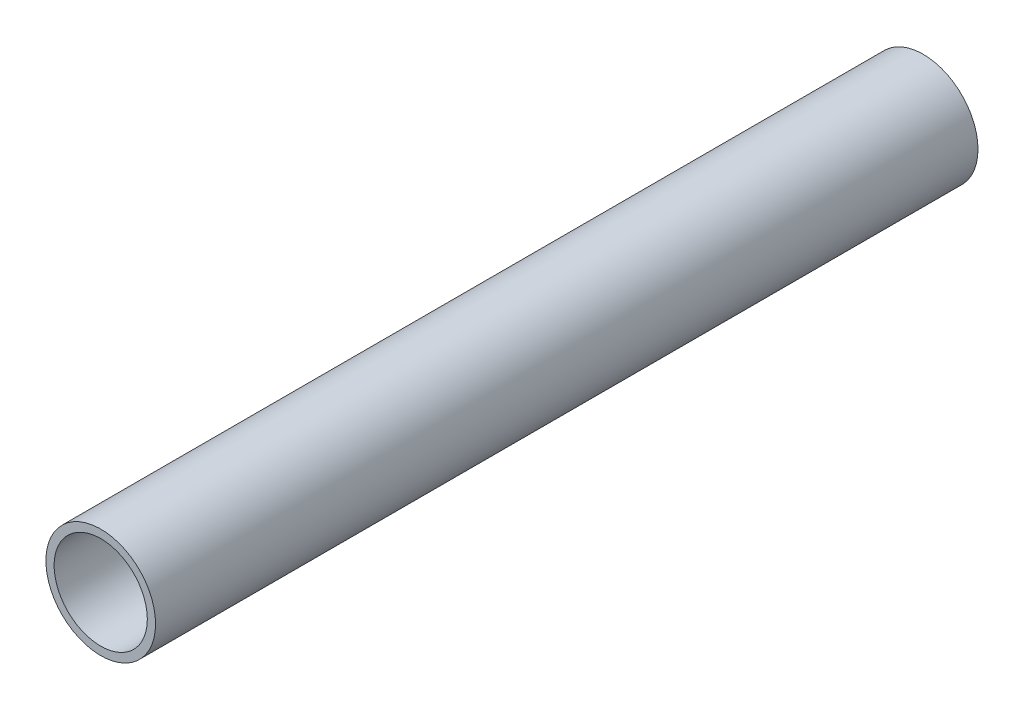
ISO-10303-21;
HEADER;
FILE_DESCRIPTION(('STEP AP214'),'2;1');
FILE_NAME('part.step','',(''),(''),'','','');
FILE_SCHEMA(('AUTOMOTIVE_DESIGN { 1 0 10303 214 1 1 1 1 }'));
ENDSEC;
DATA;
#1=APPLICATION_CONTEXT('core data for automotive mechanical design processes');
#2=APPLICATION_PROTOCOL_DEFINITION('international standard','automotive_design',2000,#1);
#3=PRODUCT_CONTEXT('',#1,'mechanical');
#4=PRODUCT('Part','Part','',(#3));
#5=PRODUCT_RELATED_PRODUCT_CATEGORY('part','',(#4));
#6=PRODUCT_DEFINITION_FORMATION('','',#4);
#7=PRODUCT_DEFINITION_CONTEXT('part definition',#1,'design');
#8=PRODUCT_DEFINITION('design','',#6,#7);
#9=PRODUCT_DEFINITION_SHAPE('','',#8);
#10=(LENGTH_UNIT() NAMED_UNIT(*) SI_UNIT(.MILLI.,.METRE.));
#11=(NAMED_UNIT(*) PLANE_ANGLE_UNIT() SI_UNIT($,.RADIAN.));
#12=(NAMED_UNIT(*) SI_UNIT($,.STERADIAN.) SOLID_ANGLE_UNIT());
#13=UNCERTAINTY_MEASURE_WITH_UNIT(LENGTH_MEASURE(1.E-05),#10,'distance_accuracy_value','');
#14=(GEOMETRIC_REPRESENTATION_CONTEXT(3) GLOBAL_UNCERTAINTY_ASSIGNED_CONTEXT((#13)) GLOBAL_UNIT_ASSIGNED_CONTEXT((#10,
#11,#12)) REPRESENTATION_CONTEXT('',''));
#15=CARTESIAN_POINT('',(0.,0.,0.));
#16=DIRECTION('',(0.,0.,1.));
#17=DIRECTION('',(1.,0.,0.));
#18=AXIS2_PLACEMENT_3D('',#15,#16,#17);
#19=CARTESIAN_POINT('',(0.,0.,150.));
#20=DIRECTION('',(0.,0.,1.));
#21=DIRECTION('',(1.,0.,0.));
#22=AXIS2_PLACEMENT_3D('',#19,#20,#21);
#23=PLANE('',#22);
#24=CARTESIAN_POINT('',(0.,0.,150.));
#25=DIRECTION('',(0.,0.,1.));
#26=DIRECTION('',(1.,0.,0.));
#27=AXIS2_PLACEMENT_3D('',#24,#25,#26);
#28=CIRCLE('',#27,10.);
#29=CARTESIAN_POINT('',(10.,0.,150.));
#30=VERTEX_POINT('',#29);
#31=EDGE_CURVE('E10',#30,#30,#28,.T.);
#32=ORIENTED_EDGE('',*,*,#31,.T.);
#33=EDGE_LOOP('',(#32));
#34=FACE_BOUND('',#33,.T.);
#35=CARTESIAN_POINT('',(0.,0.,150.));
#36=DIRECTION('',(0.,0.,1.));
#37=DIRECTION('',(1.,0.,0.));
#38=AXIS2_PLACEMENT_3D('',#35,#36,#37);
#39=CIRCLE('',#38,8.5);
#40=CARTESIAN_POINT('',(8.5,0.,150.));
#41=VERTEX_POINT('',#40);
#42=EDGE_CURVE('E39',#41,#41,#39,.T.);
#43=ORIENTED_EDGE('',*,*,#42,.F.);
#44=EDGE_LOOP('',(#43));
#45=FACE_BOUND('',#44,.T.);
#46=ADVANCED_FACE('F28',(#34,#45),#23,.T.);
#47=CARTESIAN_POINT('',(0.,0.,0.));
#48=DIRECTION('',(0.,0.,1.));
#49=DIRECTION('',(1.,0.,0.));
#50=AXIS2_PLACEMENT_3D('',#47,#48,#49);
#51=PLANE('',#50);
#52=CARTESIAN_POINT('',(0.,0.,0.));
#53=DIRECTION('',(0.,0.,1.));
#54=DIRECTION('',(1.,0.,0.));
#55=AXIS2_PLACEMENT_3D('',#52,#53,#54);
#56=CIRCLE('',#55,10.);
#57=CARTESIAN_POINT('',(10.,0.,0.));
#58=VERTEX_POINT('',#57);
#59=EDGE_CURVE('E35',#58,#58,#56,.T.);
#60=ORIENTED_EDGE('',*,*,#59,.F.);
#61=EDGE_LOOP('',(#60));
#62=FACE_BOUND('',#61,.T.);
#63=CARTESIAN_POINT('',(0.,0.,0.));
#64=DIRECTION('',(0.,0.,1.));
#65=DIRECTION('',(1.,0.,0.));
#66=AXIS2_PLACEMENT_3D('',#63,#64,#65);
#67=CIRCLE('',#66,8.5);
#68=CARTESIAN_POINT('',(8.5,0.,0.));
#69=VERTEX_POINT('',#68);
#70=EDGE_CURVE('E43',#69,#69,#67,.T.);
#71=ORIENTED_EDGE('',*,*,#70,.T.);
#72=EDGE_LOOP('',(#71));
#73=FACE_BOUND('',#72,.T.);
#74=ADVANCED_FACE('F49',(#62,#73),#51,.F.);
#75=CARTESIAN_POINT('',(0.,0.,150.));
#76=DIRECTION('',(0.,0.,-1.));
#77=DIRECTION('',(-1.,0.,0.));
#78=AXIS2_PLACEMENT_3D('',#75,#76,#77);
#79=CYLINDRICAL_SURFACE('',#78,10.);
#80=ORIENTED_EDGE('',*,*,#31,.F.);
#81=EDGE_LOOP('',(#80));
#82=FACE_BOUND('',#81,.T.);
#83=ORIENTED_EDGE('',*,*,#59,.T.);
#84=EDGE_LOOP('',(#83));
#85=FACE_BOUND('',#84,.T.);
#86=ADVANCED_FACE('F30',(#82,#85),#79,.T.);
#87=CARTESIAN_POINT('',(0.,0.,150.));
#88=DIRECTION('',(0.,0.,-1.));
#89=DIRECTION('',(-1.,0.,0.));
#90=AXIS2_PLACEMENT_3D('',#87,#88,#89);
#91=CYLINDRICAL_SURFACE('',#90,8.5);
#92=ORIENTED_EDGE('',*,*,#42,.T.);
#93=EDGE_LOOP('',(#92));
#94=FACE_BOUND('',#93,.T.);
#95=ORIENTED_EDGE('',*,*,#70,.F.);
#96=EDGE_LOOP('',(#95));
#97=FACE_BOUND('',#96,.T.);
#98=ADVANCED_FACE('F51',(#94,#97),#91,.F.);
#99=CLOSED_SHELL('',(#46,#74,#86,#98));
#100=MANIFOLD_SOLID_BREP('B2',#99);
#101=ADVANCED_BREP_SHAPE_REPRESENTATION('',(#18,#100),#14);
#102=SHAPE_DEFINITION_REPRESENTATION(#9,#101);
ENDSEC;
END-ISO-10303-21;
